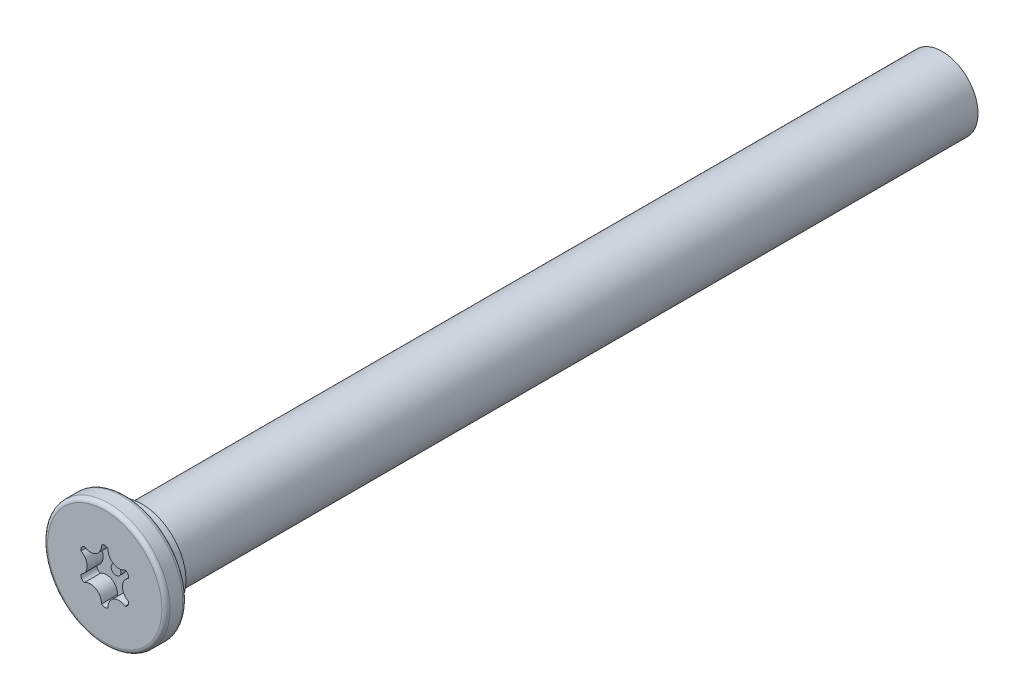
from build123d import *

# Parameters (mm, degrees)
SKETCH2_W           = 1.3
SKETCH2_H           = 3.81
SKETCH2_W_2         = 12.7
SKETCH2_H_2         = 2.23
CUT_EXTRUDE3_DEPTH  = 1
FILLET12_R          = 0.254
CUT_EXTRUDE6_START  = -12.7
SKETCH7_R           = 2.23
CUT_EXTRUDE6_DEPTH  = 12.7
SKETCH11_R          = 2.738000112
SKETCH11_R_2        = 2.230000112
BOSS_EXTRUDE1_DEPTH = 1.016
SKETCH12_R          = 2.230000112
BOSS_EXTRUDE2_DEPTH = 12.7
SKETCH14_R          = 0.3
BOSS_EXTRUDE4_DEPTH = 0.3
CUT_EXTRUDE7_START  = -12.7
SKETCH15_R          = 2.230000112
CUT_EXTRUDE7_DEPTH  = 12.7
SKETCH16_R          = 2.230000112
BOSS_EXTRUDE5_DEPTH = 50.8


with BuildPart() as part:
    # Sketch2 → Revolve1 (revolve)
    with BuildSketch(Plane(origin=(0, 0, 0), x_dir=(0, 0, -1), z_dir=(1, 0, 0)), mode=Mode.PRIVATE) as revolve1_sk:
        with Locations((0.65, 1.905)):
            Rectangle(SKETCH2_W, SKETCH2_H)
        with Locations((7.65, 1.115)):
            Rectangle(SKETCH2_W_2, SKETCH2_H_2)
    revolve(revolve1_sk.sketch.rotate(Axis((0, 0, -1.3), (0, 0, -1)), 90), axis=Axis((0, 0, -1.3), (0, 0, -1)))

    # Sketch3 → Cut-Extrude3 (cut)
    with BuildSketch(Plane.XY):
        with BuildLine():
            ThreePointArc((-0.205060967, 1.589373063), (0, 1.674312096), (0.205060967, 1.589373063))
            ThreePointArc((0.205060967, 1.589373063), (0.54882888, 0.950599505), (1.273906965, 0.972274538))
            ThreePointArc((1.273906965, 0.972274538), (1.449996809, 0.837156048), (1.478967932, 0.617098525))
            ThreePointArc((1.478967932, 0.617098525), (1.097657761, 0), (1.478967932, -0.617098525))
            ThreePointArc((1.478967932, -0.617098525), (1.449996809, -0.837156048), (1.273906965, -0.972274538))
            ThreePointArc((1.273906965, -0.972274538), (0.54882888, -0.950599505), (0.205060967, -1.589373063))
            ThreePointArc((0.205060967, -1.589373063), (0, -1.674312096), (-0.205060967, -1.589373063))
            ThreePointArc((-0.205060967, -1.589373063), (-0.54882888, -0.950599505), (-1.273906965, -0.972274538))
            ThreePointArc((-1.273906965, -0.972274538), (-1.449996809, -0.837156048), (-1.478967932, -0.617098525))
            ThreePointArc((-1.478967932, -0.617098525), (-1.097657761, 0), (-1.478967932, 0.617098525))
            ThreePointArc((-1.478967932, 0.617098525), (-1.449996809, 0.837156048), (-1.273906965, 0.972274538))
            ThreePointArc((-1.273906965, 0.972274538), (-0.54882888, 0.950599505), (-0.205060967, 1.589373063))
        make_face()
    extrude(amount=-CUT_EXTRUDE3_DEPTH, mode=Mode.SUBTRACT)

    # Fillet12
    fillet12_edges = [part.edges().sort_by_distance(p)[0] for p in [
        (-3.81, 0, 0),
        (-3.81, 0, -1.3),
    ]]
    fillet(fillet12_edges, radius=FILLET12_R)

    # Sketch7 → Cut-Extrude6 (cut)
    with BuildSketch(Plane(origin=(0, 0, -14), x_dir=(-1, 0, 0), z_dir=(0, 0, -1)).offset(CUT_EXTRUDE6_START)):
        Circle(SKETCH7_R)
    extrude(amount=CUT_EXTRUDE6_DEPTH, mode=Mode.SUBTRACT)

    # Sketch11 → Boss-Extrude1 (add)
    with BuildSketch(Plane(origin=(0, 0, -1.3), x_dir=(-1, 0, 0), z_dir=(0, 0, -1))):
        with Locations(Location((0, 0, 0), (0, 0, 180))):
            Circle(SKETCH11_R)
        Circle(SKETCH11_R_2, mode=Mode.SUBTRACT)
    extrude(amount=BOSS_EXTRUDE1_DEPTH)

    # Sketch12 → Boss-Extrude2 (add)
    with BuildSketch(Plane(origin=(0, 0, -1.3), x_dir=(-1, 0, 0), z_dir=(0, 0, -1))):
        Circle(SKETCH12_R)
    extrude(amount=BOSS_EXTRUDE2_DEPTH)

    # Sketch14 → Boss-Extrude4 (add)
    with BuildSketch(Plane.XY.offset(-1)):
        Circle(SKETCH14_R)
    extrude(amount=BOSS_EXTRUDE4_DEPTH)

    # Sketch15 → Cut-Extrude7 (cut)
    with BuildSketch(Plane(origin=(0, 0, -14), x_dir=(-1, 0, 0), z_dir=(0, 0, -1)).offset(CUT_EXTRUDE7_START)):
        Circle(SKETCH15_R)
    extrude(amount=CUT_EXTRUDE7_DEPTH, mode=Mode.SUBTRACT)

    # Sketch16 → Boss-Extrude5 (add)
    with BuildSketch(Plane(origin=(0, 0, -1.3), x_dir=(-1, 0, 0), z_dir=(0, 0, -1))):
        Circle(SKETCH16_R)
    extrude(amount=BOSS_EXTRUDE5_DEPTH)


solid = part.part
